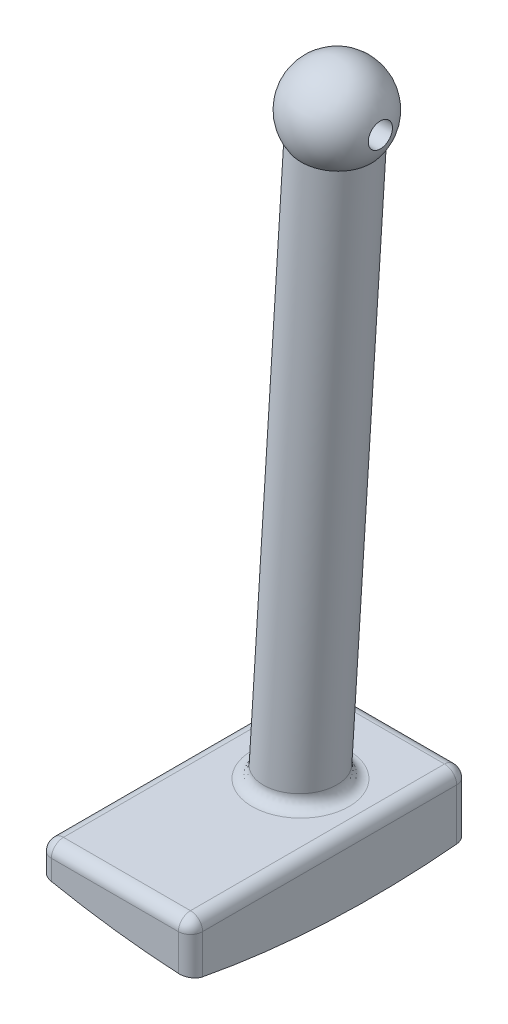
from build123d import *

# Parameters (mm, degrees)
SKETCH3_W          = 107.235310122
SKETCH3_H          = 199.649479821
CUT_EXTRUDE1_DEPTH = 208.460447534
SKETCH4_W          = 55.203650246
SKETCH4_H          = 23.267469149
CUT_EXTRUDE2_DEPTH = 108.581402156
SKETCH5_W          = 65.685681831
SKETCH5_H          = 17.306846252
CUT_EXTRUDE3_DEPTH = 102.48285434
FILLET1_R          = 1.27
SKETCH10_W         = 31.456356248
SKETCH10_H         = 1.27


with BuildPart() as part:
    # Sketch2 → Revolve1 (revolve)
    with BuildSketch(Plane.XY):
        with BuildLine():
            Line((-3.81, -95.173769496), (-3.81, -88.113686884))
            Line((-3.81, -88.113686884), (-19.685, -88.113686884))
            Line((-19.685, -88.113686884), (-19.685, -93.193686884))
            ThreePointArc((-19.685, -93.193686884), (-11.789144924, -94.517609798), (-3.81, -95.173769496))
        make_face()
    revolve(axis=Axis((104.775, 0, 0), (-1, 0, 0)))

    # Sketch3 → Cut-Extrude1 (cut, through all)
    with BuildSketch(Plane(origin=(0, -88.113686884, 0), x_dir=(-1, 0, 0), z_dir=(0, 1, 0))):
        with Locations((-15.257056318, -0.290610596)):
            Rectangle(SKETCH3_W, SKETCH3_H)
    extrude(amount=CUT_EXTRUDE1_DEPTH, mode=Mode.SUBTRACT)

    # Sketch4 → Cut-Extrude2 (cut, through all)
    with BuildSketch(Plane.XY.offset(-10.16)):
        with Locations((0.319137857, -88.561804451)):
            Rectangle(SKETCH4_W, SKETCH4_H)
    extrude(amount=-CUT_EXTRUDE2_DEPTH, mode=Mode.SUBTRACT)

    # Sketch5 → Cut-Extrude3 (cut, through all)
    with BuildSketch(Plane.XY.offset(19.05)):
        with Locations((-0.616299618, -91.244955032)):
            Rectangle(SKETCH5_W, SKETCH5_H)
    extrude(amount=CUT_EXTRUDE3_DEPTH, mode=Mode.SUBTRACT)

    # Sketch9 → Revolve3 (revolve)
    with BuildSketch(Plane.XY):
        with BuildLine():
            Line((-15.208651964, -88.113686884), (-11.405982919, -88.349924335))
            Line((-11.405982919, -88.349924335), (-7.201302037, -20.667980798))
            ThreePointArc((-7.201302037, -20.667980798), (-11.589059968, -23.008484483), (-11.472905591, -27.980092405))
            Line((-11.472905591, -27.980092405), (-15.208651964, -88.113686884))
        make_face()
    revolve(axis=Axis((-11.789144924, -94.517609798, 0), (0.06200458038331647, 0.9980758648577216, 0)))

    # Fillet1
    fillet1_edges = [part.edges().sort_by_distance(p)[0] for p in [
        (-19.685, -88.113686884, 4.445),
        (-11.7475, -88.113686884, -10.16),
        (-19.685, -90.375947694, -10.16),
        (-3.81, -91.371800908, -10.16),
        (-3.81, -88.113686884, 4.445),
        (-11.7475, -88.113686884, 19.05),
        (-19.685, -89.669782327, 19.05),
        (-3.81, -90.680721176, 19.05),
        (-7.573961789, -88.113686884, 3e-09),
    ]]
    fillet(fillet1_edges, radius=FILLET1_R)

    # Sketch10 → Cut-Revolve1 (revolve, cut)
    with BuildSketch(Plane.XY, mode=Mode.PRIVATE) as cut_revolve1_sk:
        with Locations((-0.51952616, -24.765)):
            Rectangle(SKETCH10_W, SKETCH10_H)
    revolve(cut_revolve1_sk.sketch.rotate(Axis((-16.247704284, -25.4, 0), (1, 0, 0)), 90), axis=Axis((-16.247704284, -25.4, 0), (1, 0, 0)), mode=Mode.SUBTRACT)


solid = part.part
